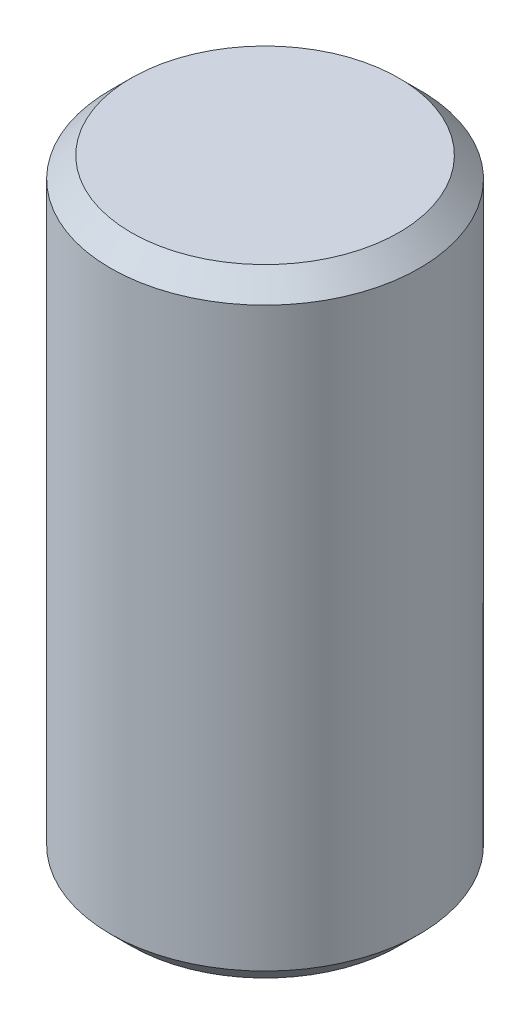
from build123d import *

# Parameters (mm, degrees)
SKETCH1_R      = 0.75
EXTRUDE1_DEPTH = 3
CHAMFER1_SIZE  = 0.1


with BuildPart() as part:
    # Sketch1 → Extrude1 (new body)
    with BuildSketch(Plane(origin=(0, 0, 0), x_dir=(1, 0, 0), z_dir=(0, 1, 0))):
        with Locations(Location((0, 0, 0), (0, 0, 270))):
            Circle(SKETCH1_R)
    extrude(amount=-EXTRUDE1_DEPTH)

    # Chamfer1
    chamfer1_edges = [part.edges().sort_by_distance(p)[0] for p in [
        (0, 0, -0.75),
        (0, -3, -0.75),
    ]]
    chamfer(chamfer1_edges, length=CHAMFER1_SIZE)


solid = part.part
